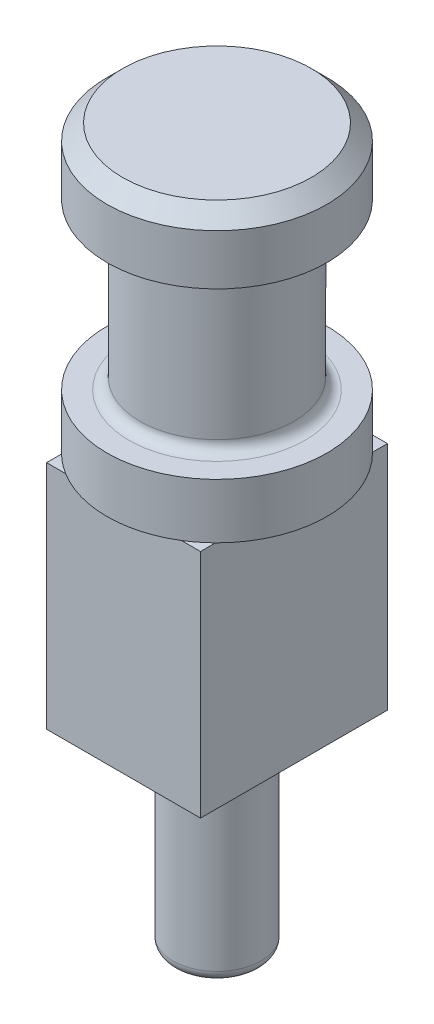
ISO-10303-21;
HEADER;
FILE_DESCRIPTION(('STEP AP214'),'2;1');
FILE_NAME('part.step','',(''),(''),'','','');
FILE_SCHEMA(('AUTOMOTIVE_DESIGN { 1 0 10303 214 1 1 1 1 }'));
ENDSEC;
DATA;
#1=APPLICATION_CONTEXT('core data for automotive mechanical design processes');
#2=APPLICATION_PROTOCOL_DEFINITION('international standard','automotive_design',2000,#1);
#3=PRODUCT_CONTEXT('',#1,'mechanical');
#4=PRODUCT('Part','Part','',(#3));
#5=PRODUCT_RELATED_PRODUCT_CATEGORY('part','',(#4));
#6=PRODUCT_DEFINITION_FORMATION('','',#4);
#7=PRODUCT_DEFINITION_CONTEXT('part definition',#1,'design');
#8=PRODUCT_DEFINITION('design','',#6,#7);
#9=PRODUCT_DEFINITION_SHAPE('','',#8);
#10=(LENGTH_UNIT() NAMED_UNIT(*) SI_UNIT(.MILLI.,.METRE.));
#11=(NAMED_UNIT(*) PLANE_ANGLE_UNIT() SI_UNIT($,.RADIAN.));
#12=(NAMED_UNIT(*) SI_UNIT($,.STERADIAN.) SOLID_ANGLE_UNIT());
#13=UNCERTAINTY_MEASURE_WITH_UNIT(LENGTH_MEASURE(1.E-05),#10,'distance_accuracy_value','');
#14=(GEOMETRIC_REPRESENTATION_CONTEXT(3) GLOBAL_UNCERTAINTY_ASSIGNED_CONTEXT((#13)) GLOBAL_UNIT_ASSIGNED_CONTEXT((#10,
#11,#12)) REPRESENTATION_CONTEXT('',''));
#15=CARTESIAN_POINT('',(0.,0.,0.));
#16=DIRECTION('',(0.,0.,1.));
#17=DIRECTION('',(1.,0.,0.));
#18=AXIS2_PLACEMENT_3D('',#15,#16,#17);
#19=CARTESIAN_POINT('',(10.,19.9545848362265,0.));
#20=DIRECTION('',(0.,1.,0.));
#21=DIRECTION('',(0.,0.,1.));
#22=AXIS2_PLACEMENT_3D('',#19,#20,#21);
#23=PLANE('',#22);
#24=CARTESIAN_POINT('',(0.,19.9545848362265,0.));
#25=DIRECTION('',(0.,1.,0.));
#26=DIRECTION('',(0.,0.,1.));
#27=AXIS2_PLACEMENT_3D('',#24,#25,#26);
#28=CIRCLE('',#27,9.99999999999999);
#29=CARTESIAN_POINT('',(7.,19.9545848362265,7.14142842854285));
#30=VERTEX_POINT('',#29);
#31=CARTESIAN_POINT('',(7.,19.9545848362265,-7.14142842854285));
#32=VERTEX_POINT('',#31);
#33=EDGE_CURVE('E176',#30,#32,#28,.T.);
#34=ORIENTED_EDGE('',*,*,#33,.F.);
#35=DIRECTION('',(0.,0.,1.));
#36=VECTOR('',#35,1.);
#37=CARTESIAN_POINT('',(7.,19.9545848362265,-8.5));
#38=LINE('',#37,#36);
#39=EDGE_CURVE('E161',#32,#30,#38,.T.);
#40=ORIENTED_EDGE('',*,*,#39,.F.);
#41=EDGE_LOOP('',(#34,#40));
#42=FACE_BOUND('',#41,.T.);
#43=ADVANCED_FACE('F48',(#42),#23,.F.);
#44=CARTESIAN_POINT('',(-7.,19.9545848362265,-7.14142842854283));
#45=VERTEX_POINT('',#44);
#46=CARTESIAN_POINT('',(-7.,19.9545848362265,7.14142842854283));
#47=VERTEX_POINT('',#46);
#48=EDGE_CURVE('E277',#45,#47,#28,.T.);
#49=ORIENTED_EDGE('',*,*,#48,.F.);
#50=DIRECTION('',(0.,0.,1.));
#51=VECTOR('',#50,1.);
#52=CARTESIAN_POINT('',(-7.,19.9545848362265,-8.5));
#53=LINE('',#52,#51);
#54=EDGE_CURVE('E62',#45,#47,#53,.T.);
#55=ORIENTED_EDGE('',*,*,#54,.T.);
#56=EDGE_LOOP('',(#49,#55));
#57=FACE_BOUND('',#56,.T.);
#58=ADVANCED_FACE('F241',(#57),#23,.F.);
#59=DIRECTION('',(-1.,0.,0.));
#60=VECTOR('',#59,1.);
#61=CARTESIAN_POINT('',(-7.,19.9545848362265,8.5));
#62=LINE('',#61,#60);
#63=CARTESIAN_POINT('',(5.26782687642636,19.9545848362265,8.5));
#64=VERTEX_POINT('',#63);
#65=CARTESIAN_POINT('',(-5.26782687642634,19.9545848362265,8.5));
#66=VERTEX_POINT('',#65);
#67=EDGE_CURVE('E148',#64,#66,#62,.T.);
#68=ORIENTED_EDGE('',*,*,#67,.F.);
#69=EDGE_CURVE('E171',#66,#64,#28,.T.);
#70=ORIENTED_EDGE('',*,*,#69,.F.);
#71=EDGE_LOOP('',(#68,#70));
#72=FACE_BOUND('',#71,.T.);
#73=ADVANCED_FACE('F248',(#72),#23,.F.);
#74=CARTESIAN_POINT('',(0.,45.9545848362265,0.));
#75=DIRECTION('',(0.,-1.,0.));
#76=DIRECTION('',(0.,0.,-1.));
#77=AXIS2_PLACEMENT_3D('',#74,#75,#76);
#78=PLANE('',#77);
#79=CARTESIAN_POINT('',(0.,45.9545848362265,0.));
#80=DIRECTION('',(0.,1.,0.));
#81=DIRECTION('',(0.,0.,1.));
#82=AXIS2_PLACEMENT_3D('',#79,#80,#81);
#83=CIRCLE('',#82,8.58578643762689);
#84=CARTESIAN_POINT('',(0.,45.9545848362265,8.58578643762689));
#85=VERTEX_POINT('',#84);
#86=EDGE_CURVE('E185',#85,#85,#83,.T.);
#87=ORIENTED_EDGE('',*,*,#86,.T.);
#88=EDGE_LOOP('',(#87));
#89=FACE_BOUND('',#88,.T.);
#90=ADVANCED_FACE('F236',(#89),#78,.F.);
#91=CARTESIAN_POINT('',(0.,44.5403712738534,0.));
#92=DIRECTION('',(0.,-1.,0.));
#93=DIRECTION('',(0.,0.,-1.));
#94=AXIS2_PLACEMENT_3D('',#91,#92,#93);
#95=CONICAL_SURFACE('',#94,9.99999999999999,0.785398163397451);
#96=ORIENTED_EDGE('',*,*,#86,.F.);
#97=EDGE_LOOP('',(#96));
#98=FACE_BOUND('',#97,.T.);
#99=CARTESIAN_POINT('',(0.,44.5403712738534,0.));
#100=DIRECTION('',(0.,1.,0.));
#101=DIRECTION('',(0.,0.,1.));
#102=AXIS2_PLACEMENT_3D('',#99,#100,#101);
#103=CIRCLE('',#102,9.99999999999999);
#104=CARTESIAN_POINT('',(0.,44.5403712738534,9.99999999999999));
#105=VERTEX_POINT('',#104);
#106=EDGE_CURVE('E182',#105,#105,#103,.T.);
#107=ORIENTED_EDGE('',*,*,#106,.T.);
#108=EDGE_LOOP('',(#107));
#109=FACE_BOUND('',#108,.T.);
#110=ADVANCED_FACE('F230',(#98,#109),#95,.T.);
#111=CARTESIAN_POINT('',(0.,45.9545848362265,0.));
#112=DIRECTION('',(0.,1.,0.));
#113=DIRECTION('',(0.,0.,1.));
#114=AXIS2_PLACEMENT_3D('',#111,#112,#113);
#115=CYLINDRICAL_SURFACE('',#114,9.99999999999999);
#116=ORIENTED_EDGE('',*,*,#106,.F.);
#117=EDGE_LOOP('',(#116));
#118=FACE_BOUND('',#117,.T.);
#119=CARTESIAN_POINT('',(0.,39.9545848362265,0.));
#120=DIRECTION('',(0.,1.,0.));
#121=DIRECTION('',(0.,0.,1.));
#122=AXIS2_PLACEMENT_3D('',#119,#120,#121);
#123=CIRCLE('',#122,9.99999999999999);
#124=CARTESIAN_POINT('',(0.,39.9545848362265,9.99999999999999));
#125=VERTEX_POINT('',#124);
#126=EDGE_CURVE('E179',#125,#125,#123,.T.);
#127=ORIENTED_EDGE('',*,*,#126,.T.);
#128=EDGE_LOOP('',(#127));
#129=FACE_BOUND('',#128,.T.);
#130=ADVANCED_FACE('F225',(#118,#129),#115,.T.);
#131=CARTESIAN_POINT('',(10.,39.9545848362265,0.));
#132=DIRECTION('',(0.,1.,0.));
#133=DIRECTION('',(0.,0.,1.));
#134=AXIS2_PLACEMENT_3D('',#131,#132,#133);
#135=PLANE('',#134);
#136=CARTESIAN_POINT('',(0.,39.9545848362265,0.));
#137=DIRECTION('',(0.,1.,0.));
#138=DIRECTION('',(0.,0.,1.));
#139=AXIS2_PLACEMENT_3D('',#136,#137,#138);
#140=CIRCLE('',#139,7.99999999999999);
#141=CARTESIAN_POINT('',(0.,39.9545848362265,7.99999999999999));
#142=VERTEX_POINT('',#141);
#143=EDGE_CURVE('E11',#142,#142,#140,.T.);
#144=ORIENTED_EDGE('',*,*,#143,.T.);
#145=EDGE_LOOP('',(#144));
#146=FACE_BOUND('',#145,.T.);
#147=ORIENTED_EDGE('',*,*,#126,.F.);
#148=EDGE_LOOP('',(#147));
#149=FACE_BOUND('',#148,.T.);
#150=ADVANCED_FACE('F214',(#146,#149),#135,.F.);
#151=CARTESIAN_POINT('',(0.,45.9545848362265,0.));
#152=DIRECTION('',(0.,1.,0.));
#153=DIRECTION('',(0.,0.,1.));
#154=AXIS2_PLACEMENT_3D('',#151,#152,#153);
#155=CYLINDRICAL_SURFACE('',#154,6.99999999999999);
#156=CARTESIAN_POINT('',(0.,25.9545848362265,0.));
#157=DIRECTION('',(0.,-1.,0.));
#158=DIRECTION('',(0.,0.,-1.));
#159=AXIS2_PLACEMENT_3D('',#156,#157,#158);
#160=CIRCLE('',#159,6.99999999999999);
#161=CARTESIAN_POINT('',(0.,25.9545848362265,-6.99999999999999));
#162=VERTEX_POINT('',#161);
#163=EDGE_CURVE('E197',#162,#162,#160,.F.);
#164=ORIENTED_EDGE('',*,*,#163,.T.);
#165=EDGE_LOOP('',(#164));
#166=FACE_BOUND('',#165,.T.);
#167=CARTESIAN_POINT('',(0.,38.9545848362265,0.));
#168=DIRECTION('',(0.,1.,0.));
#169=DIRECTION('',(0.,0.,1.));
#170=AXIS2_PLACEMENT_3D('',#167,#168,#169);
#171=CIRCLE('',#170,6.99999999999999);
#172=CARTESIAN_POINT('',(0.,38.9545848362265,6.99999999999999));
#173=VERTEX_POINT('',#172);
#174=EDGE_CURVE('E194',#173,#173,#171,.F.);
#175=ORIENTED_EDGE('',*,*,#174,.T.);
#176=EDGE_LOOP('',(#175));
#177=FACE_BOUND('',#176,.T.);
#178=ADVANCED_FACE('F211',(#166,#177),#155,.T.);
#179=CARTESIAN_POINT('',(7.,24.9545848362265,0.));
#180=DIRECTION('',(0.,-1.,0.));
#181=DIRECTION('',(0.,0.,-1.));
#182=AXIS2_PLACEMENT_3D('',#179,#180,#181);
#183=PLANE('',#182);
#184=CARTESIAN_POINT('',(0.,24.9545848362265,0.));
#185=DIRECTION('',(0.,-1.,0.));
#186=DIRECTION('',(0.,0.,-1.));
#187=AXIS2_PLACEMENT_3D('',#184,#185,#186);
#188=CIRCLE('',#187,7.99999999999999);
#189=CARTESIAN_POINT('',(0.,24.9545848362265,-7.99999999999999));
#190=VERTEX_POINT('',#189);
#191=EDGE_CURVE('E56',#190,#190,#188,.T.);
#192=ORIENTED_EDGE('',*,*,#191,.T.);
#193=EDGE_LOOP('',(#192));
#194=FACE_BOUND('',#193,.T.);
#195=CARTESIAN_POINT('',(0.,24.9545848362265,0.));
#196=DIRECTION('',(0.,1.,0.));
#197=DIRECTION('',(0.,0.,1.));
#198=AXIS2_PLACEMENT_3D('',#195,#196,#197);
#199=CIRCLE('',#198,9.99999999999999);
#200=CARTESIAN_POINT('',(0.,24.9545848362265,9.99999999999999));
#201=VERTEX_POINT('',#200);
#202=EDGE_CURVE('E175',#201,#201,#199,.T.);
#203=ORIENTED_EDGE('',*,*,#202,.T.);
#204=EDGE_LOOP('',(#203));
#205=FACE_BOUND('',#204,.T.);
#206=ADVANCED_FACE('F202',(#194,#205),#183,.F.);
#207=CARTESIAN_POINT('',(0.,45.9545848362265,0.));
#208=DIRECTION('',(0.,1.,0.));
#209=DIRECTION('',(0.,0.,1.));
#210=AXIS2_PLACEMENT_3D('',#207,#208,#209);
#211=CYLINDRICAL_SURFACE('',#210,9.99999999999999);
#212=ORIENTED_EDGE('',*,*,#202,.F.);
#213=EDGE_LOOP('',(#212));
#214=FACE_BOUND('',#213,.T.);
#215=EDGE_CURVE('E172',#64,#30,#28,.T.);
#216=ORIENTED_EDGE('',*,*,#215,.T.);
#217=ORIENTED_EDGE('',*,*,#33,.T.);
#218=CARTESIAN_POINT('',(0.,19.9545848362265,0.));
#219=DIRECTION('',(0.,1.,0.));
#220=DIRECTION('',(0.,0.,1.));
#221=AXIS2_PLACEMENT_3D('',#218,#219,#220);
#222=CIRCLE('',#221,9.99999999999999);
#223=CARTESIAN_POINT('',(5.26782687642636,19.9545848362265,-8.5));
#224=VERTEX_POINT('',#223);
#225=EDGE_CURVE('E167',#32,#224,#222,.T.);
#226=ORIENTED_EDGE('',*,*,#225,.T.);
#227=CARTESIAN_POINT('',(-5.26782687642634,19.9545848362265,-8.5));
#228=VERTEX_POINT('',#227);
#229=EDGE_CURVE('E288',#224,#228,#28,.T.);
#230=ORIENTED_EDGE('',*,*,#229,.T.);
#231=EDGE_CURVE('E117',#228,#45,#222,.T.);
#232=ORIENTED_EDGE('',*,*,#231,.T.);
#233=ORIENTED_EDGE('',*,*,#48,.T.);
#234=EDGE_CURVE('E160',#47,#66,#222,.T.);
#235=ORIENTED_EDGE('',*,*,#234,.T.);
#236=ORIENTED_EDGE('',*,*,#69,.T.);
#237=EDGE_LOOP('',(#216,#217,#226,#230,#232,#233,#235,#236));
#238=FACE_BOUND('',#237,.T.);
#239=ADVANCED_FACE('F253',(#214,#238),#211,.T.);
#240=ORIENTED_EDGE('',*,*,#229,.F.);
#241=DIRECTION('',(-1.,0.,0.));
#242=VECTOR('',#241,1.);
#243=CARTESIAN_POINT('',(-7.,19.9545848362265,-8.5));
#244=LINE('',#243,#242);
#245=EDGE_CURVE('E121',#224,#228,#244,.T.);
#246=ORIENTED_EDGE('',*,*,#245,.T.);
#247=EDGE_LOOP('',(#240,#246));
#248=FACE_BOUND('',#247,.T.);
#249=ADVANCED_FACE('F208',(#248),#23,.F.);
#250=CARTESIAN_POINT('',(0.,25.9545848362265,0.));
#251=DIRECTION('',(0.,-1.,0.));
#252=DIRECTION('',(0.,0.,-1.));
#253=AXIS2_PLACEMENT_3D('',#250,#251,#252);
#254=TOROIDAL_SURFACE('',#253,7.99999999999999,1.);
#255=ORIENTED_EDGE('',*,*,#191,.F.);
#256=EDGE_LOOP('',(#255));
#257=FACE_BOUND('',#256,.T.);
#258=ORIENTED_EDGE('',*,*,#163,.F.);
#259=EDGE_LOOP('',(#258));
#260=FACE_BOUND('',#259,.T.);
#261=ADVANCED_FACE('F205',(#257,#260),#254,.F.);
#262=CARTESIAN_POINT('',(0.,38.9545848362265,0.));
#263=DIRECTION('',(0.,1.,0.));
#264=DIRECTION('',(0.,0.,1.));
#265=AXIS2_PLACEMENT_3D('',#262,#263,#264);
#266=TOROIDAL_SURFACE('',#265,7.99999999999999,1.);
#267=ORIENTED_EDGE('',*,*,#174,.F.);
#268=EDGE_LOOP('',(#267));
#269=FACE_BOUND('',#268,.T.);
#270=ORIENTED_EDGE('',*,*,#143,.F.);
#271=EDGE_LOOP('',(#270));
#272=FACE_BOUND('',#271,.T.);
#273=ADVANCED_FACE('F50',(#269,#272),#266,.F.);
#274=CARTESIAN_POINT('',(-7.,19.9545848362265,-8.5));
#275=DIRECTION('',(0.,1.,0.));
#276=DIRECTION('',(0.,0.,1.));
#277=AXIS2_PLACEMENT_3D('',#274,#275,#276);
#278=PLANE('',#277);
#279=ORIENTED_EDGE('',*,*,#225,.F.);
#280=CARTESIAN_POINT('',(7.,19.9545848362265,-8.5));
#281=VERTEX_POINT('',#280);
#282=EDGE_CURVE('E157',#281,#32,#38,.T.);
#283=ORIENTED_EDGE('',*,*,#282,.F.);
#284=EDGE_CURVE('E124',#281,#224,#244,.T.);
#285=ORIENTED_EDGE('',*,*,#284,.T.);
#286=EDGE_LOOP('',(#279,#283,#285));
#287=FACE_BOUND('',#286,.T.);
#288=ADVANCED_FACE('F220',(#287),#278,.T.);
#289=ORIENTED_EDGE('',*,*,#215,.F.);
#290=CARTESIAN_POINT('',(7.,19.9545848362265,8.5));
#291=VERTEX_POINT('',#290);
#292=EDGE_CURVE('E144',#291,#64,#62,.T.);
#293=ORIENTED_EDGE('',*,*,#292,.F.);
#294=EDGE_CURVE('E162',#30,#291,#38,.T.);
#295=ORIENTED_EDGE('',*,*,#294,.F.);
#296=EDGE_LOOP('',(#289,#293,#295));
#297=FACE_BOUND('',#296,.T.);
#298=ADVANCED_FACE('F280',(#297),#278,.T.);
#299=ORIENTED_EDGE('',*,*,#231,.F.);
#300=CARTESIAN_POINT('',(-7.,19.9545848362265,-8.5));
#301=VERTEX_POINT('',#300);
#302=EDGE_CURVE('E113',#228,#301,#244,.T.);
#303=ORIENTED_EDGE('',*,*,#302,.T.);
#304=EDGE_CURVE('E115',#301,#45,#53,.T.);
#305=ORIENTED_EDGE('',*,*,#304,.T.);
#306=EDGE_LOOP('',(#299,#303,#305));
#307=FACE_BOUND('',#306,.T.);
#308=ADVANCED_FACE('F114',(#307),#278,.T.);
#309=CARTESIAN_POINT('',(7.,19.9545848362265,-8.5));
#310=DIRECTION('',(1.,0.,0.));
#311=DIRECTION('',(0.,1.,0.));
#312=AXIS2_PLACEMENT_3D('',#309,#310,#311);
#313=PLANE('',#312);
#314=ORIENTED_EDGE('',*,*,#39,.T.);
#315=ORIENTED_EDGE('',*,*,#294,.T.);
#316=DIRECTION('',(0.,1.,0.));
#317=VECTOR('',#316,1.);
#318=CARTESIAN_POINT('',(7.,19.9545848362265,8.5));
#319=LINE('',#318,#317);
#320=CARTESIAN_POINT('',(7.00000000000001,-1.04541516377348,8.5));
#321=VERTEX_POINT('',#320);
#322=EDGE_CURVE('E122',#321,#291,#319,.T.);
#323=ORIENTED_EDGE('',*,*,#322,.F.);
#324=DIRECTION('',(0.,0.,1.));
#325=VECTOR('',#324,1.);
#326=CARTESIAN_POINT('',(7.00000000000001,-1.04541516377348,-8.5));
#327=LINE('',#326,#325);
#328=CARTESIAN_POINT('',(7.00000000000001,-1.04541516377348,-8.5));
#329=VERTEX_POINT('',#328);
#330=EDGE_CURVE('E163',#329,#321,#327,.T.);
#331=ORIENTED_EDGE('',*,*,#330,.F.);
#332=DIRECTION('',(0.,1.,0.));
#333=VECTOR('',#332,1.);
#334=CARTESIAN_POINT('',(7.,19.9545848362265,-8.5));
#335=LINE('',#334,#333);
#336=EDGE_CURVE('E138',#329,#281,#335,.T.);
#337=ORIENTED_EDGE('',*,*,#336,.T.);
#338=ORIENTED_EDGE('',*,*,#282,.T.);
#339=EDGE_LOOP('',(#314,#315,#323,#331,#337,#338));
#340=FACE_BOUND('',#339,.T.);
#341=ADVANCED_FACE('F285',(#340),#313,.T.);
#342=CARTESIAN_POINT('',(-7.,-1.04541516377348,-8.5));
#343=DIRECTION('',(-1.,0.,0.));
#344=DIRECTION('',(0.,0.,1.));
#345=AXIS2_PLACEMENT_3D('',#342,#343,#344);
#346=PLANE('',#345);
#347=ORIENTED_EDGE('',*,*,#54,.F.);
#348=ORIENTED_EDGE('',*,*,#304,.F.);
#349=DIRECTION('',(0.,-1.,0.));
#350=VECTOR('',#349,1.);
#351=CARTESIAN_POINT('',(-7.,-1.04541516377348,-8.5));
#352=LINE('',#351,#350);
#353=CARTESIAN_POINT('',(-7.,-1.04541516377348,-8.5));
#354=VERTEX_POINT('',#353);
#355=EDGE_CURVE('E127',#301,#354,#352,.T.);
#356=ORIENTED_EDGE('',*,*,#355,.T.);
#357=DIRECTION('',(0.,0.,1.));
#358=VECTOR('',#357,1.);
#359=CARTESIAN_POINT('',(-7.,-1.04541516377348,-8.5));
#360=LINE('',#359,#358);
#361=CARTESIAN_POINT('',(-7.,-1.04541516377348,8.5));
#362=VERTEX_POINT('',#361);
#363=EDGE_CURVE('E128',#354,#362,#360,.T.);
#364=ORIENTED_EDGE('',*,*,#363,.T.);
#365=DIRECTION('',(0.,-1.,0.));
#366=VECTOR('',#365,1.);
#367=CARTESIAN_POINT('',(-7.,-1.04541516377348,8.5));
#368=LINE('',#367,#366);
#369=CARTESIAN_POINT('',(-7.,19.9545848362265,8.5));
#370=VERTEX_POINT('',#369);
#371=EDGE_CURVE('E147',#370,#362,#368,.T.);
#372=ORIENTED_EDGE('',*,*,#371,.F.);
#373=EDGE_CURVE('E130',#47,#370,#53,.T.);
#374=ORIENTED_EDGE('',*,*,#373,.F.);
#375=EDGE_LOOP('',(#347,#348,#356,#364,#372,#374));
#376=FACE_BOUND('',#375,.T.);
#377=ADVANCED_FACE('F126',(#376),#346,.T.);
#378=ORIENTED_EDGE('',*,*,#234,.F.);
#379=ORIENTED_EDGE('',*,*,#373,.T.);
#380=EDGE_CURVE('E149',#66,#370,#62,.T.);
#381=ORIENTED_EDGE('',*,*,#380,.F.);
#382=EDGE_LOOP('',(#378,#379,#381));
#383=FACE_BOUND('',#382,.T.);
#384=ADVANCED_FACE('F292',(#383),#278,.T.);
#385=CARTESIAN_POINT('',(0.,0.,-8.5));
#386=DIRECTION('',(0.,0.,-1.));
#387=DIRECTION('',(-1.,0.,0.));
#388=AXIS2_PLACEMENT_3D('',#385,#386,#387);
#389=PLANE('',#388);
#390=ORIENTED_EDGE('',*,*,#284,.F.);
#391=ORIENTED_EDGE('',*,*,#336,.F.);
#392=DIRECTION('',(1.,0.,0.));
#393=VECTOR('',#392,1.);
#394=CARTESIAN_POINT('',(7.00000000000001,-1.04541516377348,-8.5));
#395=LINE('',#394,#393);
#396=EDGE_CURVE('E136',#354,#329,#395,.T.);
#397=ORIENTED_EDGE('',*,*,#396,.F.);
#398=ORIENTED_EDGE('',*,*,#355,.F.);
#399=ORIENTED_EDGE('',*,*,#302,.F.);
#400=ORIENTED_EDGE('',*,*,#245,.F.);
#401=EDGE_LOOP('',(#390,#391,#397,#398,#399,#400));
#402=FACE_BOUND('',#401,.T.);
#403=ADVANCED_FACE('F133',(#402),#389,.T.);
#404=CARTESIAN_POINT('',(0.,0.,8.5));
#405=DIRECTION('',(0.,0.,-1.));
#406=DIRECTION('',(-1.,0.,0.));
#407=AXIS2_PLACEMENT_3D('',#404,#405,#406);
#408=PLANE('',#407);
#409=ORIENTED_EDGE('',*,*,#292,.T.);
#410=ORIENTED_EDGE('',*,*,#67,.T.);
#411=ORIENTED_EDGE('',*,*,#380,.T.);
#412=ORIENTED_EDGE('',*,*,#371,.T.);
#413=DIRECTION('',(1.,0.,0.));
#414=VECTOR('',#413,1.);
#415=CARTESIAN_POINT('',(7.00000000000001,-1.04541516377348,8.5));
#416=LINE('',#415,#414);
#417=EDGE_CURVE('E152',#362,#321,#416,.T.);
#418=ORIENTED_EDGE('',*,*,#417,.T.);
#419=ORIENTED_EDGE('',*,*,#322,.T.);
#420=EDGE_LOOP('',(#409,#410,#411,#412,#418,#419));
#421=FACE_BOUND('',#420,.T.);
#422=ADVANCED_FACE('F281',(#421),#408,.F.);
#423=CARTESIAN_POINT('',(4.00000000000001,-19.0454151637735,0.));
#424=DIRECTION('',(0.,1.,0.));
#425=DIRECTION('',(0.,0.,1.));
#426=AXIS2_PLACEMENT_3D('',#423,#424,#425);
#427=PLANE('',#426);
#428=CARTESIAN_POINT('',(0.,-19.0454151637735,0.));
#429=DIRECTION('',(0.,1.,0.));
#430=DIRECTION('',(0.,0.,1.));
#431=AXIS2_PLACEMENT_3D('',#428,#429,#430);
#432=CIRCLE('',#431,2.99999999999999);
#433=CARTESIAN_POINT('',(0.,-19.0454151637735,2.99999999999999));
#434=VERTEX_POINT('',#433);
#435=EDGE_CURVE('E191',#434,#434,#432,.F.);
#436=ORIENTED_EDGE('',*,*,#435,.T.);
#437=EDGE_LOOP('',(#436));
#438=FACE_BOUND('',#437,.T.);
#439=ADVANCED_FACE('F319',(#438),#427,.F.);
#440=CARTESIAN_POINT('',(0.,-18.0454151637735,0.));
#441=DIRECTION('',(0.,1.,0.));
#442=DIRECTION('',(0.,0.,1.));
#443=AXIS2_PLACEMENT_3D('',#440,#441,#442);
#444=TOROIDAL_SURFACE('',#443,2.99999999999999,1.);
#445=ORIENTED_EDGE('',*,*,#435,.F.);
#446=EDGE_LOOP('',(#445));
#447=FACE_BOUND('',#446,.T.);
#448=CARTESIAN_POINT('',(0.,-18.0454151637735,0.));
#449=DIRECTION('',(0.,1.,0.));
#450=DIRECTION('',(0.,0.,1.));
#451=AXIS2_PLACEMENT_3D('',#448,#449,#450);
#452=CIRCLE('',#451,3.99999999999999);
#453=CARTESIAN_POINT('',(0.,-18.0454151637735,3.99999999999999));
#454=VERTEX_POINT('',#453);
#455=EDGE_CURVE('E188',#454,#454,#452,.T.);
#456=ORIENTED_EDGE('',*,*,#455,.F.);
#457=EDGE_LOOP('',(#456));
#458=FACE_BOUND('',#457,.T.);
#459=ADVANCED_FACE('F324',(#447,#458),#444,.T.);
#460=CARTESIAN_POINT('',(0.,45.9545848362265,0.));
#461=DIRECTION('',(0.,1.,0.));
#462=DIRECTION('',(0.,0.,1.));
#463=AXIS2_PLACEMENT_3D('',#460,#461,#462);
#464=CYLINDRICAL_SURFACE('',#463,3.99999999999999);
#465=ORIENTED_EDGE('',*,*,#455,.T.);
#466=EDGE_LOOP('',(#465));
#467=FACE_BOUND('',#466,.T.);
#468=CARTESIAN_POINT('',(0.,-1.04541516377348,0.));
#469=DIRECTION('',(0.,1.,0.));
#470=DIRECTION('',(0.,0.,1.));
#471=AXIS2_PLACEMENT_3D('',#468,#469,#470);
#472=CIRCLE('',#471,3.99999999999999);
#473=CARTESIAN_POINT('',(0.,-1.04541516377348,3.99999999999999));
#474=VERTEX_POINT('',#473);
#475=EDGE_CURVE('E168',#474,#474,#472,.T.);
#476=ORIENTED_EDGE('',*,*,#475,.F.);
#477=EDGE_LOOP('',(#476));
#478=FACE_BOUND('',#477,.T.);
#479=ADVANCED_FACE('F330',(#467,#478),#464,.T.);
#480=CARTESIAN_POINT('',(7.00000000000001,-1.04541516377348,0.));
#481=DIRECTION('',(0.,1.,0.));
#482=DIRECTION('',(0.,0.,1.));
#483=AXIS2_PLACEMENT_3D('',#480,#481,#482);
#484=PLANE('',#483);
#485=ORIENTED_EDGE('',*,*,#396,.T.);
#486=ORIENTED_EDGE('',*,*,#330,.T.);
#487=ORIENTED_EDGE('',*,*,#417,.F.);
#488=ORIENTED_EDGE('',*,*,#363,.F.);
#489=EDGE_LOOP('',(#485,#486,#487,#488));
#490=FACE_BOUND('',#489,.T.);
#491=ORIENTED_EDGE('',*,*,#475,.T.);
#492=EDGE_LOOP('',(#491));
#493=FACE_BOUND('',#492,.T.);
#494=ADVANCED_FACE('F295',(#490,#493),#484,.F.);
#495=CLOSED_SHELL('',(#43,#58,#73,#90,#110,#130,#150,#178,#206,#239,#249,#261,#273,#288,#298,
#308,#341,#377,#384,#403,#422,#439,#459,#479,#494));
#496=MANIFOLD_SOLID_BREP('B2',#495);
#497=ADVANCED_BREP_SHAPE_REPRESENTATION('',(#18,#496),#14);
#498=SHAPE_DEFINITION_REPRESENTATION(#9,#497);
ENDSEC;
END-ISO-10303-21;
